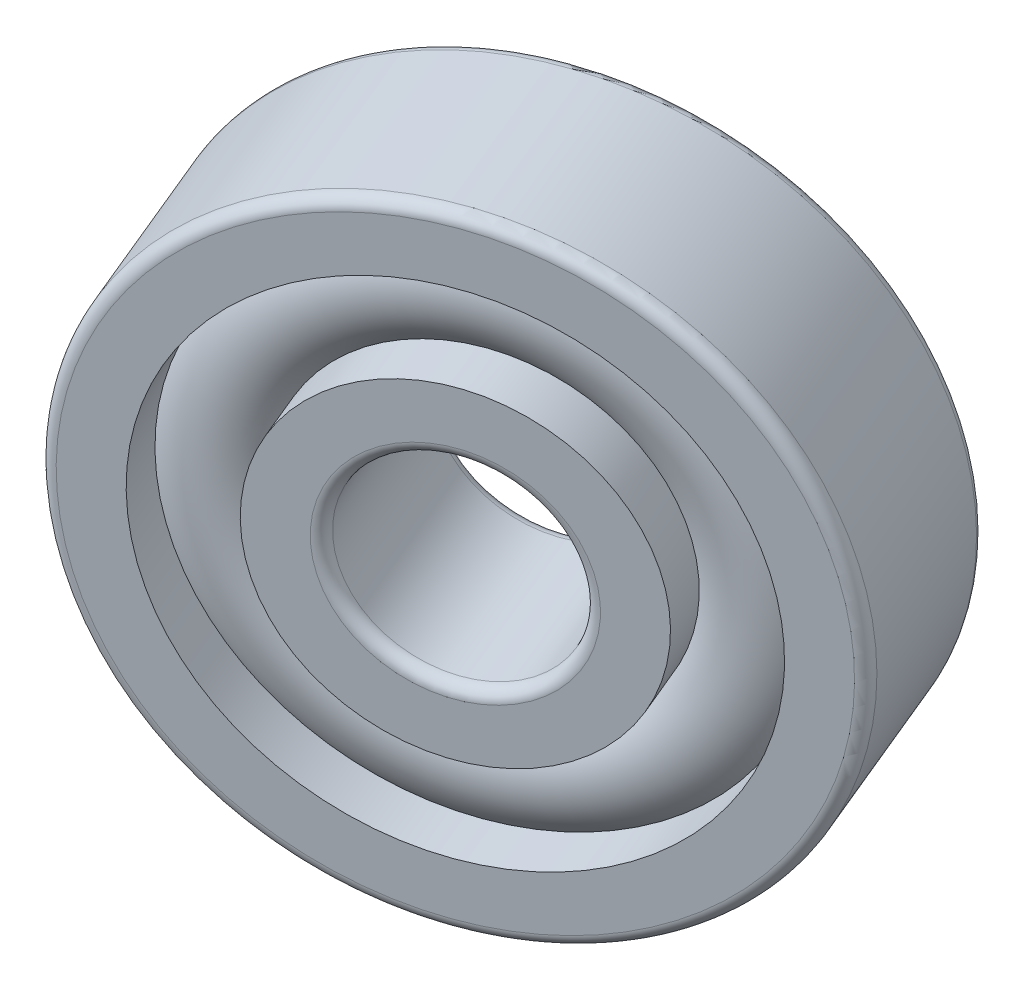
ISO-10303-21;
HEADER;
FILE_DESCRIPTION(('STEP AP214'),'2;1');
FILE_NAME('part.step','',(''),(''),'','','');
FILE_SCHEMA(('AUTOMOTIVE_DESIGN { 1 0 10303 214 1 1 1 1 }'));
ENDSEC;
DATA;
#1=APPLICATION_CONTEXT('core data for automotive mechanical design processes');
#2=APPLICATION_PROTOCOL_DEFINITION('international standard','automotive_design',2000,#1);
#3=PRODUCT_CONTEXT('',#1,'mechanical');
#4=PRODUCT('Part','Part','',(#3));
#5=PRODUCT_RELATED_PRODUCT_CATEGORY('part','',(#4));
#6=PRODUCT_DEFINITION_FORMATION('','',#4);
#7=PRODUCT_DEFINITION_CONTEXT('part definition',#1,'design');
#8=PRODUCT_DEFINITION('design','',#6,#7);
#9=PRODUCT_DEFINITION_SHAPE('','',#8);
#10=(LENGTH_UNIT() NAMED_UNIT(*) SI_UNIT(.MILLI.,.METRE.));
#11=(NAMED_UNIT(*) PLANE_ANGLE_UNIT() SI_UNIT($,.RADIAN.));
#12=(NAMED_UNIT(*) SI_UNIT($,.STERADIAN.) SOLID_ANGLE_UNIT());
#13=UNCERTAINTY_MEASURE_WITH_UNIT(LENGTH_MEASURE(1.E-05),#10,'distance_accuracy_value','');
#14=(GEOMETRIC_REPRESENTATION_CONTEXT(3) GLOBAL_UNCERTAINTY_ASSIGNED_CONTEXT((#13)) GLOBAL_UNIT_ASSIGNED_CONTEXT((#10,
#11,#12)) REPRESENTATION_CONTEXT('',''));
#15=CARTESIAN_POINT('',(0.,0.,0.));
#16=DIRECTION('',(0.,0.,1.));
#17=DIRECTION('',(1.,0.,0.));
#18=AXIS2_PLACEMENT_3D('',#15,#16,#17);
#19=CARTESIAN_POINT('',(42.4343030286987,-0.267173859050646,3.78497855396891));
#20=DIRECTION('',(-0.364454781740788,0.0340887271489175,-0.930596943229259));
#21=DIRECTION('',(-0.931138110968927,0.,0.364666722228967));
#22=AXIS2_PLACEMENT_3D('',#19,#20,#21);
#23=CYLINDRICAL_SURFACE('',#22,2.5);
#24=CARTESIAN_POINT('',(34.1110669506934,0.511327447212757,-17.4675291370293));
#25=DIRECTION('',(-0.364454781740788,0.0340887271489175,-0.930596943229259));
#26=DIRECTION('',(-0.93059694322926,-0.0499144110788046,0.362626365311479));
#27=AXIS2_PLACEMENT_3D('',#24,#25,#26);
#28=CIRCLE('',#27,2.5);
#29=CARTESIAN_POINT('',(31.7845745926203,0.386541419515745,-16.5609632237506));
#30=VERTEX_POINT('',#29);
#31=EDGE_CURVE('E69',#30,#30,#28,.F.);
#32=ORIENTED_EDGE('',*,*,#31,.F.);
#33=EDGE_LOOP('',(#32));
#34=FACE_BOUND('',#33,.T.);
#35=CARTESIAN_POINT('',(35.7146679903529,0.361337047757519,-13.3729025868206));
#36=DIRECTION('',(-0.364454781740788,0.0340887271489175,-0.930596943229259));
#37=DIRECTION('',(-0.930596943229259,-0.0499144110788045,0.36262636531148));
#38=AXIS2_PLACEMENT_3D('',#35,#36,#37);
#39=CIRCLE('',#38,2.5);
#40=CARTESIAN_POINT('',(33.3881756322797,0.236551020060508,-12.4663366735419));
#41=VERTEX_POINT('',#40);
#42=EDGE_CURVE('E131',#41,#41,#39,.T.);
#43=ORIENTED_EDGE('',*,*,#42,.F.);
#44=EDGE_LOOP('',(#43));
#45=FACE_BOUND('',#44,.T.);
#46=ADVANCED_FACE('F17',(#34,#45),#23,.F.);
#47=CARTESIAN_POINT('',(35.7146679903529,0.36133704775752,-13.3729025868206));
#48=DIRECTION('',(-0.364454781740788,0.0340887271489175,-0.930596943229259));
#49=DIRECTION('',(-0.93059694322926,-0.0499144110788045,0.36262636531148));
#50=AXIS2_PLACEMENT_3D('',#47,#48,#49);
#51=TOROIDAL_SURFACE('',#50,2.8,0.3);
#52=ORIENTED_EDGE('',*,*,#42,.T.);
#53=EDGE_LOOP('',(#52));
#54=FACE_BOUND('',#53,.T.);
#55=CARTESIAN_POINT('',(35.8240044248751,0.351110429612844,-13.0937235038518));
#56=DIRECTION('',(0.364454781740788,-0.0340887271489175,0.930596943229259));
#57=DIRECTION('',(-0.930596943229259,-0.0499144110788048,0.36262636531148));
#58=AXIS2_PLACEMENT_3D('',#55,#56,#57);
#59=CIRCLE('',#58,2.8);
#60=CARTESIAN_POINT('',(38.4296758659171,0.490870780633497,-14.1090773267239));
#61=VERTEX_POINT('',#60);
#62=CARTESIAN_POINT('',(33.2183329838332,0.211350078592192,-12.0783696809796));
#63=VERTEX_POINT('',#62);
#64=EDGE_CURVE('E58',#61,#63,#59,.F.);
#65=ORIENTED_EDGE('',*,*,#64,.F.);
#66=CARTESIAN_POINT('',(35.8240044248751,0.351110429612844,-13.0937235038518));
#67=DIRECTION('',(0.364454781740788,-0.0340887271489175,0.930596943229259));
#68=DIRECTION('',(0.930596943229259,0.0499144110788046,-0.36262636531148));
#69=AXIS2_PLACEMENT_3D('',#66,#67,#68);
#70=CIRCLE('',#69,2.8);
#71=EDGE_CURVE('E56',#63,#61,#70,.F.);
#72=ORIENTED_EDGE('',*,*,#71,.F.);
#73=EDGE_LOOP('',(#65,#72));
#74=FACE_BOUND('',#73,.T.);
#75=ADVANCED_FACE('F60',(#54,#74),#51,.T.);
#76=CARTESIAN_POINT('',(34.1110669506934,0.511327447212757,-17.4675291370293));
#77=DIRECTION('',(-0.364454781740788,0.0340887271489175,-0.930596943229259));
#78=DIRECTION('',(-0.93059694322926,-0.0499144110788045,0.36262636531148));
#79=AXIS2_PLACEMENT_3D('',#76,#77,#78);
#80=TOROIDAL_SURFACE('',#79,2.8,0.3);
#81=CARTESIAN_POINT('',(34.0017305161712,0.521554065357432,-17.7467082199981));
#82=DIRECTION('',(-0.364454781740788,0.0340887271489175,-0.930596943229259));
#83=DIRECTION('',(-0.930596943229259,-0.0499144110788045,0.36262636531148));
#84=AXIS2_PLACEMENT_3D('',#81,#82,#83);
#85=CIRCLE('',#84,2.80000000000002);
#86=CARTESIAN_POINT('',(36.6074019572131,0.661314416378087,-18.7620620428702));
#87=VERTEX_POINT('',#86);
#88=CARTESIAN_POINT('',(31.3960590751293,0.381793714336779,-16.7313543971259));
#89=VERTEX_POINT('',#88);
#90=EDGE_CURVE('E63',#87,#89,#85,.F.);
#91=ORIENTED_EDGE('',*,*,#90,.F.);
#92=CARTESIAN_POINT('',(34.0017305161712,0.521554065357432,-17.7467082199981));
#93=DIRECTION('',(-0.364454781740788,0.0340887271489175,-0.930596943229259));
#94=DIRECTION('',(0.93059694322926,0.049914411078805,-0.362626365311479));
#95=AXIS2_PLACEMENT_3D('',#92,#93,#94);
#96=CIRCLE('',#95,2.8);
#97=EDGE_CURVE('E107',#89,#87,#96,.F.);
#98=ORIENTED_EDGE('',*,*,#97,.F.);
#99=EDGE_LOOP('',(#91,#98));
#100=FACE_BOUND('',#99,.T.);
#101=ORIENTED_EDGE('',*,*,#31,.T.);
#102=EDGE_LOOP('',(#101));
#103=FACE_BOUND('',#102,.T.);
#104=ADVANCED_FACE('F89',(#100,#103),#80,.T.);
#105=CARTESIAN_POINT('',(35.6825362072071,4.49352250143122,-12.8865786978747));
#106=DIRECTION('',(0.364454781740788,-0.0340887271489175,0.93059694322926));
#107=DIRECTION('',(0.931138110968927,0.,-0.364666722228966));
#108=AXIS2_PLACEMENT_3D('',#105,#106,#107);
#109=PLANE('',#108);
#110=ORIENTED_EDGE('',*,*,#71,.T.);
#111=ORIENTED_EDGE('',*,*,#64,.T.);
#112=EDGE_LOOP('',(#110,#111));
#113=FACE_BOUND('',#112,.T.);
#114=CARTESIAN_POINT('',(35.8240044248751,0.351110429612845,-13.0937235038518));
#115=DIRECTION('',(-0.364454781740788,0.0340887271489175,-0.930596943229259));
#116=DIRECTION('',(-0.931138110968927,0.,0.364666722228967));
#117=AXIS2_PLACEMENT_3D('',#114,#115,#116);
#118=CIRCLE('',#117,4.15);
#119=CARTESIAN_POINT('',(31.9597812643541,0.351110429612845,-11.5803566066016));
#120=VERTEX_POINT('',#119);
#121=EDGE_CURVE('E146',#120,#120,#118,.T.);
#122=ORIENTED_EDGE('',*,*,#121,.F.);
#123=EDGE_LOOP('',(#122));
#124=FACE_BOUND('',#123,.T.);
#125=ADVANCED_FACE('F67',(#113,#124),#109,.T.);
#126=CARTESIAN_POINT('',(33.9062820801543,3.31643449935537,-17.6069478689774));
#127=DIRECTION('',(-0.364454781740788,0.0340887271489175,-0.930596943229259));
#128=DIRECTION('',(-0.931138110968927,0.,0.364666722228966));
#129=AXIS2_PLACEMENT_3D('',#126,#127,#128);
#130=PLANE('',#129);
#131=ORIENTED_EDGE('',*,*,#90,.T.);
#132=ORIENTED_EDGE('',*,*,#97,.T.);
#133=EDGE_LOOP('',(#131,#132));
#134=FACE_BOUND('',#133,.T.);
#135=CARTESIAN_POINT('',(34.0017305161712,0.521554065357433,-17.7467082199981));
#136=DIRECTION('',(-0.364454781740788,0.0340887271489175,-0.930596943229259));
#137=DIRECTION('',(-0.931138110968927,0.,0.364666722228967));
#138=AXIS2_PLACEMENT_3D('',#135,#136,#137);
#139=CIRCLE('',#138,4.15);
#140=CARTESIAN_POINT('',(30.1375073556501,0.521554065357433,-16.2333413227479));
#141=VERTEX_POINT('',#140);
#142=EDGE_CURVE('E142',#141,#141,#139,.F.);
#143=ORIENTED_EDGE('',*,*,#142,.F.);
#144=EDGE_LOOP('',(#143));
#145=FACE_BOUND('',#144,.T.);
#146=ADVANCED_FACE('F88',(#134,#145),#130,.T.);
#147=CARTESIAN_POINT('',(42.4343030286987,-0.267173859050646,3.78497855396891));
#148=DIRECTION('',(-0.364454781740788,0.0340887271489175,-0.930596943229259));
#149=DIRECTION('',(-0.931138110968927,0.,0.364666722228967));
#150=AXIS2_PLACEMENT_3D('',#147,#148,#149);
#151=CYLINDRICAL_SURFACE('',#150,4.15);
#152=ORIENTED_EDGE('',*,*,#121,.T.);
#153=EDGE_LOOP('',(#152));
#154=FACE_BOUND('',#153,.T.);
#155=CARTESIAN_POINT('',(35.3610875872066,0.394408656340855,-14.2757329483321));
#156=DIRECTION('',(0.364454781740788,-0.0340887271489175,0.930596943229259));
#157=DIRECTION('',(0.93059694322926,0.0499144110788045,-0.36262636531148));
#158=AXIS2_PLACEMENT_3D('',#155,#156,#157);
#159=CIRCLE('',#158,4.15000000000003);
#160=CARTESIAN_POINT('',(39.2230649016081,0.601553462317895,-15.7806323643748));
#161=VERTEX_POINT('',#160);
#162=EDGE_CURVE('E145',#161,#161,#159,.F.);
#163=ORIENTED_EDGE('',*,*,#162,.F.);
#164=EDGE_LOOP('',(#163));
#165=FACE_BOUND('',#164,.T.);
#166=ADVANCED_FACE('F280',(#154,#165),#151,.T.);
#167=CARTESIAN_POINT('',(42.4343030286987,-0.267173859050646,3.78497855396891));
#168=DIRECTION('',(-0.364454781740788,0.0340887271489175,-0.930596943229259));
#169=DIRECTION('',(-0.931138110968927,0.,0.364666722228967));
#170=AXIS2_PLACEMENT_3D('',#167,#168,#169);
#171=CYLINDRICAL_SURFACE('',#170,4.15);
#172=CARTESIAN_POINT('',(34.4646473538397,0.478255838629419,-16.5646987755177));
#173=DIRECTION('',(0.364454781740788,-0.0340887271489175,0.930596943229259));
#174=DIRECTION('',(0.93059694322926,0.0499144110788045,-0.362626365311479));
#175=AXIS2_PLACEMENT_3D('',#172,#173,#174);
#176=CIRCLE('',#175,4.14999999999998);
#177=CARTESIAN_POINT('',(38.3266246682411,0.685400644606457,-18.0695981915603));
#178=VERTEX_POINT('',#177);
#179=EDGE_CURVE('E264',#178,#178,#176,.T.);
#180=ORIENTED_EDGE('',*,*,#179,.F.);
#181=EDGE_LOOP('',(#180));
#182=FACE_BOUND('',#181,.T.);
#183=ORIENTED_EDGE('',*,*,#142,.T.);
#184=EDGE_LOOP('',(#183));
#185=FACE_BOUND('',#184,.T.);
#186=ADVANCED_FACE('F259',(#182,#185),#171,.T.);
#187=CARTESIAN_POINT('',(34.9128674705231,0.436332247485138,-15.4202158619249));
#188=DIRECTION('',(0.364454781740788,-0.0340887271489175,0.930596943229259));
#189=DIRECTION('',(0.930596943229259,0.0499144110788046,-0.36262636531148));
#190=AXIS2_PLACEMENT_3D('',#187,#188,#189);
#191=TOROIDAL_SURFACE('',#190,5.25,1.65);
#192=CARTESIAN_POINT('',(35.3610875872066,0.394408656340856,-14.2757329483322));
#193=DIRECTION('',(-0.364454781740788,0.0340887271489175,-0.93059694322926));
#194=DIRECTION('',(-0.931138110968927,0.,0.364666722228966));
#195=AXIS2_PLACEMENT_3D('',#192,#193,#194);
#196=CIRCLE('',#195,6.35);
#197=CARTESIAN_POINT('',(29.448360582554,0.394408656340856,-11.9600992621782));
#198=VERTEX_POINT('',#197);
#199=EDGE_CURVE('E263',#198,#198,#196,.F.);
#200=ORIENTED_EDGE('',*,*,#199,.T.);
#201=EDGE_LOOP('',(#200));
#202=FACE_BOUND('',#201,.T.);
#203=ORIENTED_EDGE('',*,*,#162,.T.);
#204=EDGE_LOOP('',(#203));
#205=FACE_BOUND('',#204,.T.);
#206=ADVANCED_FACE('F254',(#202,#205),#191,.T.);
#207=CARTESIAN_POINT('',(34.9128674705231,0.436332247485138,-15.4202158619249));
#208=DIRECTION('',(0.364454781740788,-0.0340887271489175,0.930596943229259));
#209=DIRECTION('',(0.930596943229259,0.0499144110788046,-0.36262636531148));
#210=AXIS2_PLACEMENT_3D('',#207,#208,#209);
#211=TOROIDAL_SURFACE('',#210,5.25,1.65);
#212=ORIENTED_EDGE('',*,*,#179,.T.);
#213=EDGE_LOOP('',(#212));
#214=FACE_BOUND('',#213,.T.);
#215=CARTESIAN_POINT('',(34.4646473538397,0.47825583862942,-16.5646987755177));
#216=DIRECTION('',(-0.364454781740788,0.0340887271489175,-0.93059694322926));
#217=DIRECTION('',(-0.931138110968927,0.,0.364666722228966));
#218=AXIS2_PLACEMENT_3D('',#215,#216,#217);
#219=CIRCLE('',#218,6.35);
#220=CARTESIAN_POINT('',(28.551920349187,0.47825583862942,-14.2490650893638));
#221=VERTEX_POINT('',#220);
#222=EDGE_CURVE('E141',#221,#221,#219,.T.);
#223=ORIENTED_EDGE('',*,*,#222,.T.);
#224=EDGE_LOOP('',(#223));
#225=FACE_BOUND('',#224,.T.);
#226=ADVANCED_FACE('F249',(#214,#225),#211,.T.);
#227=CARTESIAN_POINT('',(42.4343030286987,-0.267173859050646,3.78497855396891));
#228=DIRECTION('',(-0.364454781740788,0.0340887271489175,-0.93059694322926));
#229=DIRECTION('',(-0.931138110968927,0.,0.364666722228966));
#230=AXIS2_PLACEMENT_3D('',#227,#228,#229);
#231=CYLINDRICAL_SURFACE('',#230,6.35);
#232=ORIENTED_EDGE('',*,*,#199,.F.);
#233=EDGE_LOOP('',(#232));
#234=FACE_BOUND('',#233,.T.);
#235=CARTESIAN_POINT('',(35.8240044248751,0.351110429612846,-13.0937235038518));
#236=DIRECTION('',(-0.364454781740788,0.0340887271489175,-0.93059694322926));
#237=DIRECTION('',(-0.931138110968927,0.,0.364666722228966));
#238=AXIS2_PLACEMENT_3D('',#235,#236,#237);
#239=CIRCLE('',#238,6.35);
#240=CARTESIAN_POINT('',(29.9112774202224,0.351110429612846,-10.7780898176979));
#241=VERTEX_POINT('',#240);
#242=EDGE_CURVE('E138',#241,#241,#239,.T.);
#243=ORIENTED_EDGE('',*,*,#242,.F.);
#244=EDGE_LOOP('',(#243));
#245=FACE_BOUND('',#244,.T.);
#246=ADVANCED_FACE('F253',(#234,#245),#231,.F.);
#247=CARTESIAN_POINT('',(42.4343030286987,-0.267173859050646,3.78497855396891));
#248=DIRECTION('',(-0.364454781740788,0.0340887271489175,-0.93059694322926));
#249=DIRECTION('',(-0.931138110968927,0.,0.364666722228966));
#250=AXIS2_PLACEMENT_3D('',#247,#248,#249);
#251=CYLINDRICAL_SURFACE('',#250,6.35);
#252=CARTESIAN_POINT('',(34.0017305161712,0.521554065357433,-17.7467082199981));
#253=DIRECTION('',(-0.364454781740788,0.0340887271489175,-0.93059694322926));
#254=DIRECTION('',(-0.931138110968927,0.,0.364666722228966));
#255=AXIS2_PLACEMENT_3D('',#252,#253,#254);
#256=CIRCLE('',#255,6.35);
#257=CARTESIAN_POINT('',(28.0890035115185,0.521554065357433,-15.4310745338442));
#258=VERTEX_POINT('',#257);
#259=EDGE_CURVE('E134',#258,#258,#256,.F.);
#260=ORIENTED_EDGE('',*,*,#259,.F.);
#261=EDGE_LOOP('',(#260));
#262=FACE_BOUND('',#261,.T.);
#263=ORIENTED_EDGE('',*,*,#222,.F.);
#264=EDGE_LOOP('',(#263));
#265=FACE_BOUND('',#264,.T.);
#266=ADVANCED_FACE('F336',(#262,#265),#251,.F.);
#267=CARTESIAN_POINT('',(35.6075410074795,6.68949998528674,-12.7767669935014));
#268=DIRECTION('',(0.364454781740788,-0.0340887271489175,0.93059694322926));
#269=DIRECTION('',(0.931138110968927,0.,-0.364666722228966));
#270=AXIS2_PLACEMENT_3D('',#267,#268,#269);
#271=PLANE('',#270);
#272=ORIENTED_EDGE('',*,*,#242,.T.);
#273=EDGE_LOOP('',(#272));
#274=FACE_BOUND('',#273,.T.);
#275=CARTESIAN_POINT('',(35.8240044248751,0.351110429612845,-13.0937235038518));
#276=DIRECTION('',(-0.364454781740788,0.0340887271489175,-0.930596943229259));
#277=DIRECTION('',(-0.930596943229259,-0.0499144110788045,0.36262636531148));
#278=AXIS2_PLACEMENT_3D('',#275,#276,#277);
#279=CIRCLE('',#278,7.70000000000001);
#280=CARTESIAN_POINT('',(28.6584079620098,-0.0332305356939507,-10.3015004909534));
#281=VERTEX_POINT('',#280);
#282=CARTESIAN_POINT('',(42.9896008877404,0.73545139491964,-15.8859465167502));
#283=VERTEX_POINT('',#282);
#284=EDGE_CURVE('E217',#281,#283,#279,.T.);
#285=ORIENTED_EDGE('',*,*,#284,.F.);
#286=CARTESIAN_POINT('',(35.8240044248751,0.351110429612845,-13.0937235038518));
#287=DIRECTION('',(-0.364454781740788,0.0340887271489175,-0.930596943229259));
#288=DIRECTION('',(0.930596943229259,0.0499144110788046,-0.36262636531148));
#289=AXIS2_PLACEMENT_3D('',#286,#287,#288);
#290=CIRCLE('',#289,7.70000000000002);
#291=EDGE_CURVE('E137',#283,#281,#290,.T.);
#292=ORIENTED_EDGE('',*,*,#291,.F.);
#293=EDGE_LOOP('',(#285,#292));
#294=FACE_BOUND('',#293,.T.);
#295=ADVANCED_FACE('F193',(#274,#294),#271,.T.);
#296=CARTESIAN_POINT('',(33.7392473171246,8.20747525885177,-17.3623672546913));
#297=DIRECTION('',(-0.364454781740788,0.0340887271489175,-0.930596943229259));
#298=DIRECTION('',(-0.931138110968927,0.,0.364666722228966));
#299=AXIS2_PLACEMENT_3D('',#296,#297,#298);
#300=PLANE('',#299);
#301=ORIENTED_EDGE('',*,*,#259,.T.);
#302=EDGE_LOOP('',(#301));
#303=FACE_BOUND('',#302,.T.);
#304=CARTESIAN_POINT('',(34.0017305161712,0.521554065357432,-17.7467082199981));
#305=DIRECTION('',(0.364454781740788,-0.0340887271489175,0.930596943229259));
#306=DIRECTION('',(0.930596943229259,0.0499144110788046,-0.36262636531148));
#307=AXIS2_PLACEMENT_3D('',#304,#305,#306);
#308=CIRCLE('',#307,7.7);
#309=CARTESIAN_POINT('',(41.1673269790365,0.905895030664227,-20.5389312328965));
#310=VERTEX_POINT('',#309);
#311=CARTESIAN_POINT('',(26.8361340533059,0.137213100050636,-14.9544852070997));
#312=VERTEX_POINT('',#311);
#313=EDGE_CURVE('E180',#310,#312,#308,.T.);
#314=ORIENTED_EDGE('',*,*,#313,.F.);
#315=CARTESIAN_POINT('',(34.0017305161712,0.521554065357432,-17.7467082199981));
#316=DIRECTION('',(0.364454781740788,-0.0340887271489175,0.930596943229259));
#317=DIRECTION('',(-0.930596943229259,-0.0499144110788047,0.36262636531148));
#318=AXIS2_PLACEMENT_3D('',#315,#316,#317);
#319=CIRCLE('',#318,7.70000000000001);
#320=EDGE_CURVE('E35',#312,#310,#319,.T.);
#321=ORIENTED_EDGE('',*,*,#320,.F.);
#322=EDGE_LOOP('',(#314,#321));
#323=FACE_BOUND('',#322,.T.);
#324=ADVANCED_FACE('F184',(#303,#323),#300,.T.);
#325=CARTESIAN_POINT('',(35.7146679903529,0.36133704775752,-13.3729025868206));
#326=DIRECTION('',(-0.364454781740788,0.0340887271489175,-0.930596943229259));
#327=DIRECTION('',(-0.930596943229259,-0.0499144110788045,0.36262636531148));
#328=AXIS2_PLACEMENT_3D('',#325,#326,#327);
#329=TOROIDAL_SURFACE('',#328,7.7,0.3);
#330=CARTESIAN_POINT('',(35.7146679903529,0.36133704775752,-13.3729025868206));
#331=DIRECTION('',(-0.364454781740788,0.0340887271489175,-0.930596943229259));
#332=DIRECTION('',(-0.931138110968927,0.,0.364666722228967));
#333=AXIS2_PLACEMENT_3D('',#330,#331,#332);
#334=CIRCLE('',#333,8.);
#335=CARTESIAN_POINT('',(28.2655631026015,0.36133704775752,-10.4555688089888));
#336=VERTEX_POINT('',#335);
#337=EDGE_CURVE('E27',#336,#336,#334,.T.);
#338=ORIENTED_EDGE('',*,*,#337,.F.);
#339=EDGE_LOOP('',(#338));
#340=FACE_BOUND('',#339,.T.);
#341=ORIENTED_EDGE('',*,*,#284,.T.);
#342=ORIENTED_EDGE('',*,*,#291,.T.);
#343=EDGE_LOOP('',(#341,#342));
#344=FACE_BOUND('',#343,.T.);
#345=ADVANCED_FACE('F169',(#340,#344),#329,.T.);
#346=CARTESIAN_POINT('',(34.1110669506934,0.511327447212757,-17.4675291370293));
#347=DIRECTION('',(-0.364454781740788,0.0340887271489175,-0.930596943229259));
#348=DIRECTION('',(-0.930596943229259,-0.0499144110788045,0.36262636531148));
#349=AXIS2_PLACEMENT_3D('',#346,#347,#348);
#350=TOROIDAL_SURFACE('',#349,7.7,0.3);
#351=ORIENTED_EDGE('',*,*,#320,.T.);
#352=ORIENTED_EDGE('',*,*,#313,.T.);
#353=EDGE_LOOP('',(#351,#352));
#354=FACE_BOUND('',#353,.T.);
#355=CARTESIAN_POINT('',(34.1110669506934,0.511327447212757,-17.4675291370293));
#356=DIRECTION('',(-0.364454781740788,0.0340887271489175,-0.930596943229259));
#357=DIRECTION('',(-0.931138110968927,0.,0.364666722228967));
#358=AXIS2_PLACEMENT_3D('',#355,#356,#357);
#359=CIRCLE('',#358,8.);
#360=CARTESIAN_POINT('',(26.661962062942,0.511327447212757,-14.5501953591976));
#361=VERTEX_POINT('',#360);
#362=EDGE_CURVE('E11',#361,#361,#359,.F.);
#363=ORIENTED_EDGE('',*,*,#362,.F.);
#364=EDGE_LOOP('',(#363));
#365=FACE_BOUND('',#364,.T.);
#366=ADVANCED_FACE('F157',(#354,#365),#350,.T.);
#367=CARTESIAN_POINT('',(42.4343030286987,-0.267173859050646,3.78497855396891));
#368=DIRECTION('',(-0.364454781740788,0.0340887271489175,-0.930596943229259));
#369=DIRECTION('',(-0.931138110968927,0.,0.364666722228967));
#370=AXIS2_PLACEMENT_3D('',#367,#368,#369);
#371=CYLINDRICAL_SURFACE('',#370,8.);
#372=ORIENTED_EDGE('',*,*,#362,.T.);
#373=EDGE_LOOP('',(#372));
#374=FACE_BOUND('',#373,.T.);
#375=ORIENTED_EDGE('',*,*,#337,.T.);
#376=EDGE_LOOP('',(#375));
#377=FACE_BOUND('',#376,.T.);
#378=ADVANCED_FACE('F168',(#374,#377),#371,.T.);
#379=CLOSED_SHELL('',(#46,#75,#104,#125,#146,#166,#186,#206,#226,#246,#266,#295,#324,#345,#366,#378));
#380=MANIFOLD_SOLID_BREP('B1',#379);
#381=ADVANCED_BREP_SHAPE_REPRESENTATION('',(#18,#380),#14);
#382=SHAPE_DEFINITION_REPRESENTATION(#9,#381);
ENDSEC;
END-ISO-10303-21;
